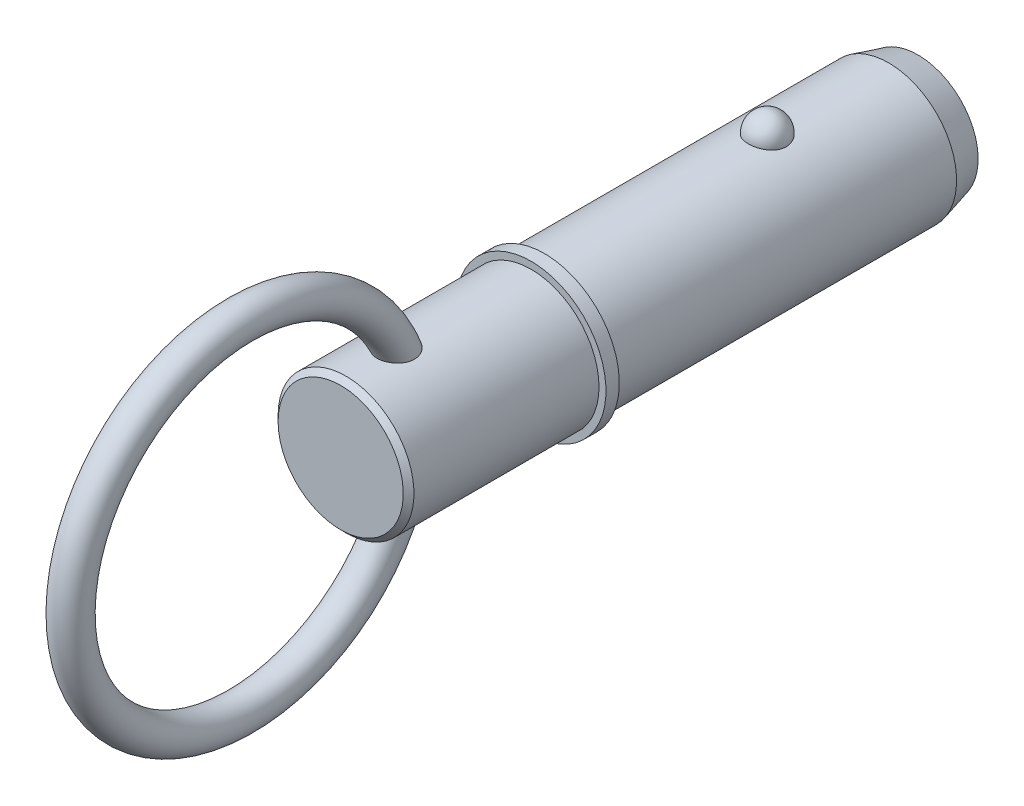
from build123d import *

# Parameters (mm, degrees)
SKETCH2_R           = 12.7
BOSS_EXTRUDE1_DEPTH = 38.1
BOSS_EXTRUDE2_START = 31.75
SKETCH3_R           = 12.7
BOSS_EXTRUDE2_DEPTH = 31.75
CHAMFER1_SIZE       = 5.5
CHAMFER1_SIZE2      = 1.473720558
SKETCH20_W          = 2.5
SKETCH20_H          = 14
SKETCH21_R          = 12.7
BOSS_EXTRUDE3_DEPTH = 38.1
CHAMFER2_SIZE       = 1
SKETCH24_R          = 3.25


with BuildPart() as part:
    # Sketch2 → Boss-Extrude1 (new body)
    with BuildSketch(Plane.XY):
        with Locations(Location((0, 0, 0), (0, 0, 180))):
            Circle(SKETCH2_R)
    extrude(amount=BOSS_EXTRUDE1_DEPTH)

    # Sketch3 → Boss-Extrude2 (add)
    with BuildSketch(Plane(origin=(0, 0, 0), x_dir=(-1, 0, 0), z_dir=(0, 0, -1)).offset(BOSS_EXTRUDE2_START)):
        Circle(SKETCH3_R)
    extrude(amount=-BOSS_EXTRUDE2_DEPTH)

    # Chamfer1
    chamfer1_edges = [part.edges().sort_by_distance(p)[0] for p in [
        (12.7, 0, -31.75),
    ]]
    chamfer1_side = [part.faces().sort_by_distance(p)[0] for p in [
        (12.7, 0, 3.175),
    ]]
    chamfer(chamfer1_edges, length=CHAMFER1_SIZE, length2=CHAMFER1_SIZE2, reference=chamfer1_side[0])

    # Sketch18 → Revolve1 (revolve)
    with BuildSketch(Plane(origin=(0, 0, 0), x_dir=(0, 0, -1), z_dir=(1, 0, 0))):
        with BuildLine():
            Line((3.56, 16.26), (3.56, 9.14))
            ThreePointArc((3.56, 9.14), (0, 12.7), (3.56, 16.26))
        make_face()
    revolve(axis=Axis((0, 16.26, -3.56), (0, -1, 0)))

    # Sketch20 → Revolve2 (revolve)
    with BuildSketch(Plane(origin=(0, 0, 0), x_dir=(0, 0, -1), z_dir=(1, 0, 0)), mode=Mode.PRIVATE) as revolve2_sk:
        with Locations((-39.35, 7)):
            Rectangle(SKETCH20_W, SKETCH20_H)
    revolve(revolve2_sk.sketch.rotate(Axis((0, 0, 33.728787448), (0, 0, 1)), 90), axis=Axis((0, 0, 33.728787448), (0, 0, 1)))

    # Sketch21 → Boss-Extrude3 (add)
    with BuildSketch(Plane(origin=(0, 0, 38.1), x_dir=(-1, 0, 0), z_dir=(0, 0, -1))):
        Circle(SKETCH21_R)
    extrude(amount=-BOSS_EXTRUDE3_DEPTH)

    # Chamfer2
    chamfer2_edges = [part.edges().sort_by_distance(p)[0] for p in [
        (12.7, 0, 76.2),
    ]]
    chamfer(chamfer2_edges, length=CHAMFER2_SIZE)

    # Sweep1: sweep along a path in Sketch23
    with BuildLine(Plane(origin=(0, 0, 0), x_dir=(0, 0, -1), z_dir=(1, 0, 0))) as sweep1_path:
        CenterArc((-94.95, 0), 31.75, 0, 360)
    # Sketch24 → Sweep1 (sweep)
    with BuildSketch(Plane(origin=(0, 0, 0), x_dir=(1, 0, 0), z_dir=(0, 1, 0))):
        with Locations((0, -63.2)):
            Circle(SKETCH24_R)
    sweep(path=sweep1_path.line)


solid = part.part
